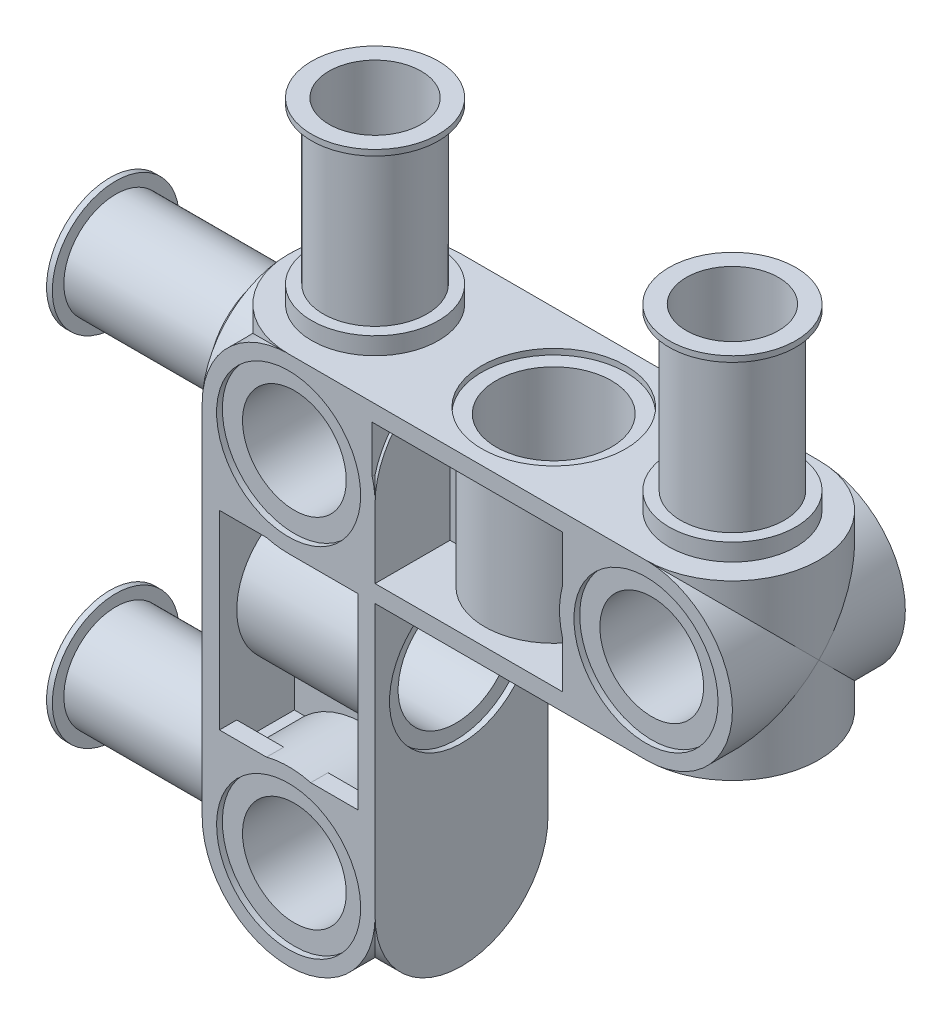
from build123d import *
from build123d.topology import SkipClean

# Parameters (mm, degrees)
EXTRUDE1_DEPTH       = 3.81
SKETCH2_R            = 2.794
CUT_EXTRUDE1_DEPTH   = 0.254
SKETCH3_R            = 2.794
EXTRUDE2_DEPTH       = 0.762
SKETCH5_R            = 2.286
SKETCH5_R_2          = 2.032
EXTRUDE4_DEPTH       = 7.112
EXTRUDE5_START       = -0.254
SKETCH6_R            = 2.794
SKETCH6_R_2          = 2.032
EXTRUDE5_DEPTH       = 0.254
EXTRUDE6_DEPTH       = 7.62
SKETCH8_R            = 2.54
CUT_EXTRUDE2_DEPTH   = 3.556
SKETCH9_R            = 2.286
CUT_EXTRUDE3_DEPTH   = 17.018118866
SKETCH10_R           = 3.175
CUT_EXTRUDE4_DEPTH   = 0.254
CUT_EXTRUDE6_DEPTH   = 3.048
SKETCH13_R           = 2.54
CUT_EXTRUDE7_DEPTH   = 15.734189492
SKETCH14_R           = 3.175
CUT_EXTRUDE8_DEPTH   = 0.254
EXTRUDE8_START       = -7.112
EXTRUDE8_DEPTH       = 7.112
EXTRUDE10_DEPTH      = 21.848124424
EXTRUDE10_DEPTH_BACK = 21.848124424
CIRPATTERN1_COUNT    = 2
CIRPATTERN1_ANGLE    = 90


with BuildPart() as part:
    # Sketch1 → Extrude1 (new body)
    with BuildSketch(Plane(origin=(0, 0, 0), x_dir=(1, 0, 0), z_dir=(0, 1, 0))):
        with BuildLine():
            Line((-7.874, 3.81), (7.874, 3.81))
            ThreePointArc((7.874, 3.81), (11.684, 0), (7.874, -3.81))
            Line((7.874, -3.81), (-7.874, -3.81))
            ThreePointArc((-7.874, -3.81), (-11.684, 0), (-7.874, 3.81))
        make_face()
    extrude(amount=EXTRUDE1_DEPTH)

    # Sketch2 → Cut-Extrude1 (cut)
    with BuildSketch(Plane.XZ):
        with Locations(Location((0, 0, 0), (0, 0, 270))):
            Circle(SKETCH2_R)
    extrude(amount=-CUT_EXTRUDE1_DEPTH, mode=Mode.SUBTRACT)

    # Sketch3 → Extrude2 (add)
    with BuildSketch(Plane.XZ):
        with Locations(Location((7.874, 0, 0), (0, 0, 90))):
            Circle(SKETCH3_R)
        with Locations(Location((-7.874, 0, 0), (0, 0, 90))):
            Circle(SKETCH3_R)
    extrude(amount=EXTRUDE2_DEPTH)

    # Sketch5 → Extrude4 (add)
    # profile 1 of 2: a face of its own
    with BuildSketch(Plane.XZ.offset(0.762)):
        with Locations(Location((7.874, 0, 0), (0, 0, 270))):
            Circle(SKETCH5_R)
        with Locations(Location((7.874, 0, 0), (0, 0, 270))):
            Circle(SKETCH5_R_2, mode=Mode.SUBTRACT)
    # profile 2 of 2: a face of its own
    with BuildSketch(Plane.XZ.offset(0.762)):
        with Locations(Location((-7.874, 0, 0), (0, 0, 270))):
            Circle(SKETCH5_R)
        with Locations(Location((-7.874, 0, 0), (0, 0, 270))):
            Circle(SKETCH5_R_2, mode=Mode.SUBTRACT)
    extrude(amount=EXTRUDE4_DEPTH)

    # Sketch6 → Extrude5 (add)
    # profile 1 of 2: a face of its own
    with BuildSketch(Plane.XZ.offset(7.874).offset(EXTRUDE5_START)):
        with Locations(Location((-7.874, 0, 0), (0, 0, 90))):
            Circle(SKETCH6_R)
        with Locations(Location((-7.874, 0, 0), (0, 0, 270))):
            Circle(SKETCH6_R_2, mode=Mode.SUBTRACT)
    # profile 2 of 2: a face of its own
    with BuildSketch(Plane.XZ.offset(7.874).offset(EXTRUDE5_START)):
        with Locations(Location((7.874, 0, 0), (0, 0, 90))):
            Circle(SKETCH6_R)
        with Locations(Location((7.874, 0, 0), (0, 0, 270))):
            Circle(SKETCH6_R_2, mode=Mode.SUBTRACT)
    extrude(amount=EXTRUDE5_DEPTH)

    # Sketch7 → Extrude6 (add)
    with BuildSketch(Plane(origin=(0, 0, -3.81), x_dir=(-1, 0, 0), z_dir=(0, 0, -1))):
        with BuildLine():
            Line((-7.874, 0), (7.874, 0))
            ThreePointArc((7.874, 0), (10.568076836, 1.115923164), (11.684, 3.81))
            Line((11.684, 3.81), (7.874, 3.81))
            Line((7.874, 3.81), (-7.874, 3.81))
            Line((-7.874, 3.81), (-11.684, 3.81))
            ThreePointArc((-11.684, 3.81), (-10.568076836, 1.115923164), (-7.874, 0))
        make_face()
    extrude(amount=-EXTRUDE6_DEPTH)

    # Sketch8 → Cut-Extrude2 (cut)
    with BuildSketch(Plane(origin=(0, 3.81, 0), x_dir=(1, 0, 0), z_dir=(0, 1, 0))):
        with Locations(Location((0, 0, 0), (0, 0, 270))):
            Circle(SKETCH8_R)
    extrude(amount=-CUT_EXTRUDE2_DEPTH, mode=Mode.SUBTRACT)

    # Sketch9 → Cut-Extrude3 (cut, through all)
    with BuildSketch(Plane.XY.offset(3.81)):
        with Locations((7.874, 3.81)):
            Circle(SKETCH9_R)
        with Locations((-7.874, 3.81)):
            Circle(SKETCH9_R)
    extrude(amount=-CUT_EXTRUDE3_DEPTH, mode=Mode.SUBTRACT)

    # Sketch10 → Cut-Extrude4 (cut)
    with BuildSketch(Plane.XY.offset(3.81)):
        with Locations((7.874, 3.81)):
            Circle(SKETCH10_R)
        with Locations((-7.874, 3.81)):
            Circle(SKETCH10_R)
    cut_extrude4 = extrude(amount=-CUT_EXTRUDE4_DEPTH, mode=Mode.SUBTRACT)

    # Mirror2: Cut-Extrude4 across plane
    add(cut_extrude4.mirror(Plane.XY), mode=Mode.SUBTRACT)

    # Sketch11 → Cut-Extrude6 (cut)
    with BuildSketch(Plane(origin=(0, 3.81, 0), x_dir=(1, 0, 0), z_dir=(0, 1, 0))):
        with BuildLine():
            Line((-5.08, -0.508), (-5.08, -3.048))
            Line((-5.08, -3.048), (-4.191, -3.048))
            Line((-4.191, -3.048), (-4.191, -3.81))
            Line((-4.191, -3.81), (4.191, -3.81))
            Line((4.191, -3.81), (4.191, -3.048))
            Line((4.191, -3.048), (5.08, -3.048))
            Line((5.08, -3.048), (5.08, -0.508))
            Line((5.08, -0.508), (3.00536853, -0.508))
            ThreePointArc((3.00536853, -0.508), (0, -3.048), (-3.00536853, -0.508))
            Line((-3.00536853, -0.508), (-5.08, -0.508))
        make_face()
        with BuildLine():
            Line((5.08, 0.508), (5.08, 3.048))
            Line((5.08, 3.048), (4.191, 3.048))
            Line((4.191, 3.048), (4.191, 3.81))
            Line((4.191, 3.81), (-4.191, 3.81))
            Line((-4.191, 3.81), (-4.191, 3.048))
            Line((-4.191, 3.048), (-5.08, 3.048))
            Line((-5.08, 3.048), (-5.08, 0.508))
            Line((-5.08, 0.508), (-3.00536853, 0.508))
            ThreePointArc((-3.00536853, 0.508), (0, 3.048), (3.00536853, 0.508))
            Line((3.00536853, 0.508), (5.08, 0.508))
        make_face()
    extrude(amount=-CUT_EXTRUDE6_DEPTH, mode=Mode.SUBTRACT)

    # Sketch13 → Cut-Extrude7 (cut, through all)
    with BuildSketch(Plane(origin=(0, 0.254, 0), x_dir=(1, 0, 0), z_dir=(0, 1, 0))):
        with Locations(Location((0, 0, 0), (0, 0, 270))):
            Circle(SKETCH13_R)
    extrude(amount=-CUT_EXTRUDE7_DEPTH, mode=Mode.SUBTRACT)

    # Sketch14 → Cut-Extrude8 (cut)
    with BuildSketch(Plane.XZ):
        with Locations(Location((0, 0, 0), (0, 0, 270))):
            Circle(SKETCH14_R)
    extrude(amount=-CUT_EXTRUDE8_DEPTH, mode=Mode.SUBTRACT)

    # Sketch17 → Extrude8 (add)
    with BuildSketch(Plane.XY.offset(3.81).offset(EXTRUDE8_START)):
        with BuildLine():
            Line((-4.064, 3.81), (-4.699, 3.81))
            ThreePointArc((-4.699, 3.81), (-7.874, 0.635), (-11.049, 3.81))
            Line((-11.049, 3.81), (-11.684, 3.81))
            ThreePointArc((-11.684, 3.81), (-7.874, 0), (-4.064, 3.81))
        make_face()
    extrude8 = extrude(amount=EXTRUDE8_DEPTH)

    # Mirror3: Extrude8 across plane
    add(extrude8.mirror(Plane(origin=(0, 0, 0), x_dir=(0, 0, 1), z_dir=(1, 0, 0))))

    # Mirror1: part across face


with BuildPart() as part_1:
    with SkipClean():  # the faces are left unmerged after this step: merging them gives an invalid solid
        add(part.part)
        add(part.part.mirror(Plane(origin=(0, 3.81, 0.015641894), x_dir=(0, 0, 1), z_dir=(0, 1, 0))))

    # Sketch18 → Extrude10 (cut, two sides: drawn at the far end of the back side and taken through both)
    with SkipClean():  # the faces are left unmerged after this step: merging them gives an invalid solid
        with BuildSketch(Plane.XY.offset(3.81).offset(-EXTRUDE10_DEPTH_BACK)):
            Polygon((-86.944177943, 0), (-14.134519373, 0), (15.632648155, 0), (88.442306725, 0), (88.442306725, -145.61931714), (-86.944177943, -145.61931714), align=None)
        extrude(amount=EXTRUDE10_DEPTH + EXTRUDE10_DEPTH_BACK, mode=Mode.SUBTRACT)


with BuildPart() as cirpattern1_1:
    # CirPattern1: pattern copy
    add(part_1.part.rotate(Axis((-7.874, 3.81, 0), (0, 0, -1)), 1 * CIRPATTERN1_ANGLE / (CIRPATTERN1_COUNT - 1)))


with BuildPart() as body_3:
    # Mirror4: mirrored copy
    add(cirpattern1_1.part.mirror(Plane(origin=(-7.874, 0, 0), x_dir=(0, 0, 1), z_dir=(1, 0, 0))))


with BuildPart() as part_2:
    add(part_1.part)

    # Combine1: union body 3
    add(body_3.part)


solid = part_2.part
